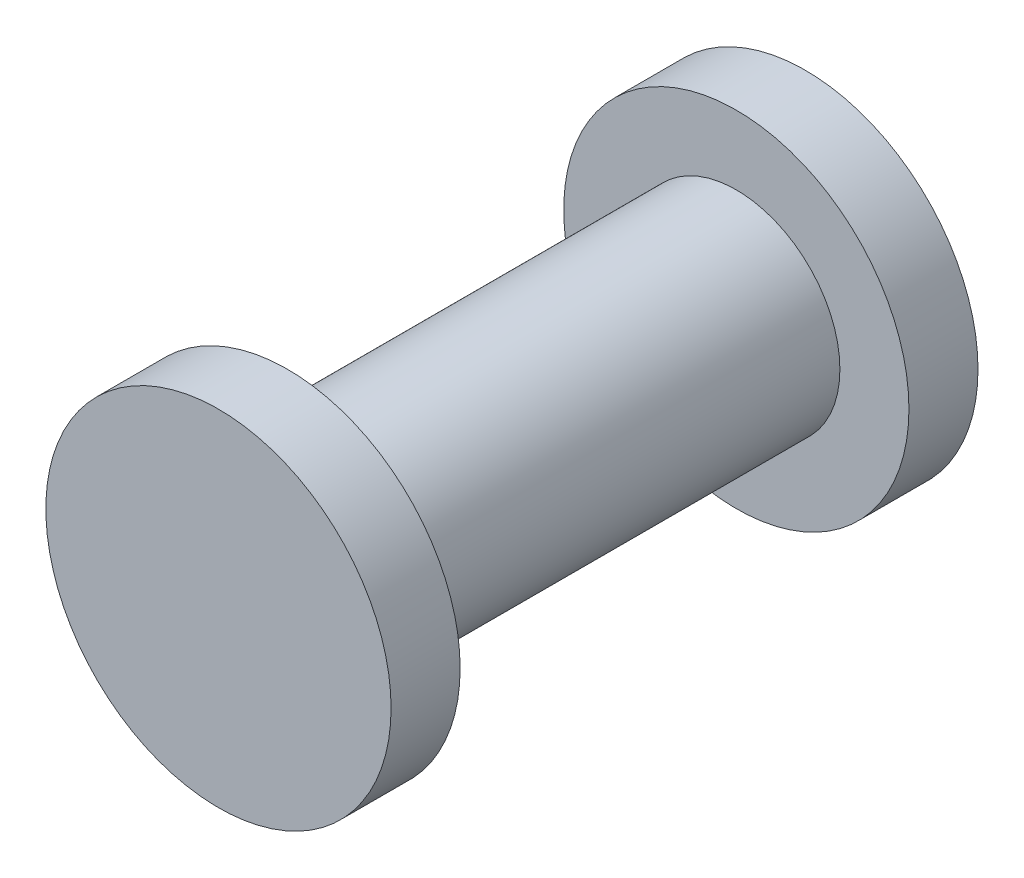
ISO-10303-21;
HEADER;
FILE_DESCRIPTION(('STEP AP214'),'2;1');
FILE_NAME('part.step','',(''),(''),'','','');
FILE_SCHEMA(('AUTOMOTIVE_DESIGN { 1 0 10303 214 1 1 1 1 }'));
ENDSEC;
DATA;
#1=APPLICATION_CONTEXT('core data for automotive mechanical design processes');
#2=APPLICATION_PROTOCOL_DEFINITION('international standard','automotive_design',2000,#1);
#3=PRODUCT_CONTEXT('',#1,'mechanical');
#4=PRODUCT('Part','Part','',(#3));
#5=PRODUCT_RELATED_PRODUCT_CATEGORY('part','',(#4));
#6=PRODUCT_DEFINITION_FORMATION('','',#4);
#7=PRODUCT_DEFINITION_CONTEXT('part definition',#1,'design');
#8=PRODUCT_DEFINITION('design','',#6,#7);
#9=PRODUCT_DEFINITION_SHAPE('','',#8);
#10=(LENGTH_UNIT() NAMED_UNIT(*) SI_UNIT(.MILLI.,.METRE.));
#11=(NAMED_UNIT(*) PLANE_ANGLE_UNIT() SI_UNIT($,.RADIAN.));
#12=(NAMED_UNIT(*) SI_UNIT($,.STERADIAN.) SOLID_ANGLE_UNIT());
#13=UNCERTAINTY_MEASURE_WITH_UNIT(LENGTH_MEASURE(1.E-05),#10,'distance_accuracy_value','');
#14=(GEOMETRIC_REPRESENTATION_CONTEXT(3) GLOBAL_UNCERTAINTY_ASSIGNED_CONTEXT((#13)) GLOBAL_UNIT_ASSIGNED_CONTEXT((#10,
#11,#12)) REPRESENTATION_CONTEXT('',''));
#15=CARTESIAN_POINT('',(0.,0.,0.));
#16=DIRECTION('',(0.,0.,1.));
#17=DIRECTION('',(1.,0.,0.));
#18=AXIS2_PLACEMENT_3D('',#15,#16,#17);
#19=CARTESIAN_POINT('',(0.,0.,-8.5));
#20=DIRECTION('',(0.,0.,1.));
#21=DIRECTION('',(1.,0.,0.));
#22=AXIS2_PLACEMENT_3D('',#19,#20,#21);
#23=CYLINDRICAL_SURFACE('',#22,5.);
#24=CARTESIAN_POINT('',(0.,0.,-8.5));
#25=DIRECTION('',(0.,0.,1.));
#26=DIRECTION('',(1.,0.,0.));
#27=AXIS2_PLACEMENT_3D('',#24,#25,#26);
#28=CIRCLE('',#27,5.);
#29=CARTESIAN_POINT('',(5.,0.,-8.5));
#30=VERTEX_POINT('',#29);
#31=EDGE_CURVE('E10',#30,#30,#28,.T.);
#32=ORIENTED_EDGE('',*,*,#31,.T.);
#33=EDGE_LOOP('',(#32));
#34=FACE_BOUND('',#33,.T.);
#35=CARTESIAN_POINT('',(0.,0.,-6.5));
#36=DIRECTION('',(0.,0.,1.));
#37=DIRECTION('',(1.,0.,0.));
#38=AXIS2_PLACEMENT_3D('',#35,#36,#37);
#39=CIRCLE('',#38,5.);
#40=CARTESIAN_POINT('',(5.,0.,-6.5));
#41=VERTEX_POINT('',#40);
#42=EDGE_CURVE('E43',#41,#41,#39,.F.);
#43=ORIENTED_EDGE('',*,*,#42,.T.);
#44=EDGE_LOOP('',(#43));
#45=FACE_BOUND('',#44,.T.);
#46=ADVANCED_FACE('F39',(#34,#45),#23,.T.);
#47=CARTESIAN_POINT('',(0.,0.,-8.5));
#48=DIRECTION('',(0.,0.,1.));
#49=DIRECTION('',(1.,0.,0.));
#50=AXIS2_PLACEMENT_3D('',#47,#48,#49);
#51=PLANE('',#50);
#52=ORIENTED_EDGE('',*,*,#31,.F.);
#53=EDGE_LOOP('',(#52));
#54=FACE_BOUND('',#53,.T.);
#55=ADVANCED_FACE('F84',(#54),#51,.F.);
#56=CARTESIAN_POINT('',(0.,0.,-6.5));
#57=DIRECTION('',(0.,0.,1.));
#58=DIRECTION('',(1.,0.,0.));
#59=AXIS2_PLACEMENT_3D('',#56,#57,#58);
#60=PLANE('',#59);
#61=ORIENTED_EDGE('',*,*,#42,.F.);
#62=EDGE_LOOP('',(#61));
#63=FACE_BOUND('',#62,.T.);
#64=CARTESIAN_POINT('',(0.,0.,-6.5));
#65=DIRECTION('',(0.,0.,1.));
#66=DIRECTION('',(1.,0.,0.));
#67=AXIS2_PLACEMENT_3D('',#64,#65,#66);
#68=CIRCLE('',#67,3.);
#69=CARTESIAN_POINT('',(3.,0.,-6.5));
#70=VERTEX_POINT('',#69);
#71=EDGE_CURVE('E58',#70,#70,#68,.T.);
#72=ORIENTED_EDGE('',*,*,#71,.F.);
#73=EDGE_LOOP('',(#72));
#74=FACE_BOUND('',#73,.T.);
#75=ADVANCED_FACE('F80',(#63,#74),#60,.T.);
#76=CARTESIAN_POINT('',(0.,0.,6.5));
#77=DIRECTION('',(0.,0.,1.));
#78=DIRECTION('',(1.,0.,0.));
#79=AXIS2_PLACEMENT_3D('',#76,#77,#78);
#80=PLANE('',#79);
#81=CARTESIAN_POINT('',(0.,0.,6.5));
#82=DIRECTION('',(0.,0.,1.));
#83=DIRECTION('',(1.,0.,0.));
#84=AXIS2_PLACEMENT_3D('',#81,#82,#83);
#85=CIRCLE('',#84,5.);
#86=CARTESIAN_POINT('',(5.,0.,6.5));
#87=VERTEX_POINT('',#86);
#88=EDGE_CURVE('E56',#87,#87,#85,.F.);
#89=ORIENTED_EDGE('',*,*,#88,.T.);
#90=EDGE_LOOP('',(#89));
#91=FACE_BOUND('',#90,.T.);
#92=CARTESIAN_POINT('',(0.,0.,6.5));
#93=DIRECTION('',(0.,0.,1.));
#94=DIRECTION('',(1.,0.,0.));
#95=AXIS2_PLACEMENT_3D('',#92,#93,#94);
#96=CIRCLE('',#95,3.);
#97=CARTESIAN_POINT('',(3.,0.,6.5));
#98=VERTEX_POINT('',#97);
#99=EDGE_CURVE('E54',#98,#98,#96,.T.);
#100=ORIENTED_EDGE('',*,*,#99,.T.);
#101=EDGE_LOOP('',(#100));
#102=FACE_BOUND('',#101,.T.);
#103=ADVANCED_FACE('F68',(#91,#102),#80,.F.);
#104=CARTESIAN_POINT('',(0.,0.,-6.5));
#105=DIRECTION('',(0.,0.,1.));
#106=DIRECTION('',(1.,0.,0.));
#107=AXIS2_PLACEMENT_3D('',#104,#105,#106);
#108=CYLINDRICAL_SURFACE('',#107,3.);
#109=CARTESIAN_POINT('',(3.,0.,-6.5));
#110=CARTESIAN_POINT('',(3.,0.,-6.36458333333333));
#111=CARTESIAN_POINT('',(3.,0.,-6.22916666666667));
#112=CARTESIAN_POINT('',(3.,0.,-5.95833333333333));
#113=CARTESIAN_POINT('',(3.,0.,-5.82291666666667));
#114=CARTESIAN_POINT('',(3.,0.,-5.55208333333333));
#115=CARTESIAN_POINT('',(3.,0.,-5.41666666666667));
#116=CARTESIAN_POINT('',(3.,0.,-5.14583333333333));
#117=CARTESIAN_POINT('',(3.,0.,-5.01041666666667));
#118=CARTESIAN_POINT('',(3.,0.,-4.73958333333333));
#119=CARTESIAN_POINT('',(3.,0.,-4.60416666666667));
#120=CARTESIAN_POINT('',(3.,0.,-4.33333333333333));
#121=CARTESIAN_POINT('',(3.,0.,-4.19791666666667));
#122=CARTESIAN_POINT('',(3.,0.,-3.92708333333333));
#123=CARTESIAN_POINT('',(3.,0.,-3.79166666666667));
#124=CARTESIAN_POINT('',(3.,0.,-3.52083333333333));
#125=CARTESIAN_POINT('',(3.,0.,-3.38541666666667));
#126=CARTESIAN_POINT('',(3.,0.,-3.11458333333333));
#127=CARTESIAN_POINT('',(3.,0.,-2.97916666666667));
#128=CARTESIAN_POINT('',(3.,0.,-2.70833333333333));
#129=CARTESIAN_POINT('',(3.,0.,-2.57291666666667));
#130=CARTESIAN_POINT('',(3.,0.,-2.30208333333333));
#131=CARTESIAN_POINT('',(3.,0.,-2.16666666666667));
#132=CARTESIAN_POINT('',(3.,0.,-1.89583333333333));
#133=CARTESIAN_POINT('',(3.,0.,-1.76041666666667));
#134=CARTESIAN_POINT('',(3.,0.,-1.48958333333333));
#135=CARTESIAN_POINT('',(3.,0.,-1.35416666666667));
#136=CARTESIAN_POINT('',(3.,0.,-1.08333333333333));
#137=CARTESIAN_POINT('',(3.,0.,-0.947916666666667));
#138=CARTESIAN_POINT('',(3.,0.,-0.677083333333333));
#139=CARTESIAN_POINT('',(3.,0.,-0.541666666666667));
#140=CARTESIAN_POINT('',(3.,0.,-0.270833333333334));
#141=CARTESIAN_POINT('',(3.,0.,-0.135416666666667));
#142=CARTESIAN_POINT('',(3.,0.,0.135416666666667));
#143=CARTESIAN_POINT('',(3.,0.,0.270833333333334));
#144=CARTESIAN_POINT('',(3.,0.,0.541666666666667));
#145=CARTESIAN_POINT('',(3.,0.,0.677083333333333));
#146=CARTESIAN_POINT('',(3.,0.,0.947916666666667));
#147=CARTESIAN_POINT('',(3.,0.,1.08333333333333));
#148=CARTESIAN_POINT('',(3.,0.,1.35416666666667));
#149=CARTESIAN_POINT('',(3.,0.,1.48958333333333));
#150=CARTESIAN_POINT('',(3.,0.,1.76041666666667));
#151=CARTESIAN_POINT('',(3.,0.,1.89583333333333));
#152=CARTESIAN_POINT('',(3.,0.,2.16666666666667));
#153=CARTESIAN_POINT('',(3.,0.,2.30208333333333));
#154=CARTESIAN_POINT('',(3.,0.,2.57291666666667));
#155=CARTESIAN_POINT('',(3.,0.,2.70833333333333));
#156=CARTESIAN_POINT('',(3.,0.,2.97916666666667));
#157=CARTESIAN_POINT('',(3.,0.,3.11458333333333));
#158=CARTESIAN_POINT('',(3.,0.,3.38541666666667));
#159=CARTESIAN_POINT('',(3.,0.,3.52083333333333));
#160=CARTESIAN_POINT('',(3.,0.,3.79166666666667));
#161=CARTESIAN_POINT('',(3.,0.,3.92708333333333));
#162=CARTESIAN_POINT('',(3.,0.,4.19791666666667));
#163=CARTESIAN_POINT('',(3.,0.,4.33333333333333));
#164=CARTESIAN_POINT('',(3.,0.,4.60416666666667));
#165=CARTESIAN_POINT('',(3.,0.,4.73958333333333));
#166=CARTESIAN_POINT('',(3.,0.,5.01041666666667));
#167=CARTESIAN_POINT('',(3.,0.,5.14583333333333));
#168=CARTESIAN_POINT('',(3.,0.,5.41666666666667));
#169=CARTESIAN_POINT('',(3.,0.,5.55208333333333));
#170=CARTESIAN_POINT('',(3.,0.,5.82291666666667));
#171=CARTESIAN_POINT('',(3.,0.,5.95833333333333));
#172=CARTESIAN_POINT('',(3.,0.,6.22916666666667));
#173=CARTESIAN_POINT('',(3.,0.,6.36458333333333));
#174=CARTESIAN_POINT('',(3.,0.,6.5));
#175=B_SPLINE_CURVE_WITH_KNOTS('',3,(#109,#110,#111,#112,#113,#114,#115,#116,#117,#118,#119,
#120,#121,#122,#123,#124,#125,#126,#127,#128,#129,#130,#131,#132,#133,#134,#135,#136,#137,#138,
#139,#140,#141,#142,#143,#144,#145,#146,#147,#148,#149,#150,#151,#152,#153,#154,#155,#156,#157,
#158,#159,#160,#161,#162,#163,#164,#165,#166,#167,#168,#169,#170,#171,#172,#173,#174),
.UNSPECIFIED.,.F.,.F.,(4,2,2,2,2,2,2,2,2,2,2,2,2,2,2,2,2,2,2,2,2,2,2,2,2,2,2,2,2,2,2,2,4),(0.,
0.40625,0.8125,1.21875,1.625,2.03125,2.4375,2.84375,3.25,3.65625,4.0625,4.46875,4.875,5.28125,
5.6875,6.09375,6.5,6.90625,7.3125,7.71875,8.125,8.53125,8.9375,9.34375,9.75,10.15625,10.5625,
10.96875,11.375,11.78125,12.1875,12.59375,13.),.UNSPECIFIED.);
#176=EDGE_CURVE('BSEAM70',#70,#98,#175,.T.);
#177=ORIENTED_EDGE('',*,*,#71,.T.);
#178=ORIENTED_EDGE('',*,*,#99,.F.);
#179=ORIENTED_EDGE('',*,*,#176,.T.);
#180=ORIENTED_EDGE('',*,*,#176,.F.);
#181=EDGE_LOOP('',(#177,#179,#178,#180));
#182=FACE_BOUND('',#181,.T.);
#183=ADVANCED_FACE('F70',(#182),#108,.T.);
#184=CARTESIAN_POINT('',(0.,0.,8.5));
#185=DIRECTION('',(0.,0.,1.));
#186=DIRECTION('',(1.,0.,0.));
#187=AXIS2_PLACEMENT_3D('',#184,#185,#186);
#188=PLANE('',#187);
#189=CARTESIAN_POINT('',(0.,0.,8.5));
#190=DIRECTION('',(0.,0.,1.));
#191=DIRECTION('',(1.,0.,0.));
#192=AXIS2_PLACEMENT_3D('',#189,#190,#191);
#193=CIRCLE('',#192,5.);
#194=CARTESIAN_POINT('',(5.,0.,8.5));
#195=VERTEX_POINT('',#194);
#196=EDGE_CURVE('E47',#195,#195,#193,.T.);
#197=ORIENTED_EDGE('',*,*,#196,.T.);
#198=EDGE_LOOP('',(#197));
#199=FACE_BOUND('',#198,.T.);
#200=ADVANCED_FACE('F72',(#199),#188,.T.);
#201=ORIENTED_EDGE('',*,*,#88,.F.);
#202=EDGE_LOOP('',(#201));
#203=FACE_BOUND('',#202,.T.);
#204=ORIENTED_EDGE('',*,*,#196,.F.);
#205=EDGE_LOOP('',(#204));
#206=FACE_BOUND('',#205,.T.);
#207=ADVANCED_FACE('F41',(#203,#206),#23,.T.);
#208=CLOSED_SHELL('',(#46,#55,#75,#103,#183,#200,#207));
#209=MANIFOLD_SOLID_BREP('B2',#208);
#210=ADVANCED_BREP_SHAPE_REPRESENTATION('',(#18,#209),#14);
#211=SHAPE_DEFINITION_REPRESENTATION(#9,#210);
ENDSEC;
END-ISO-10303-21;
